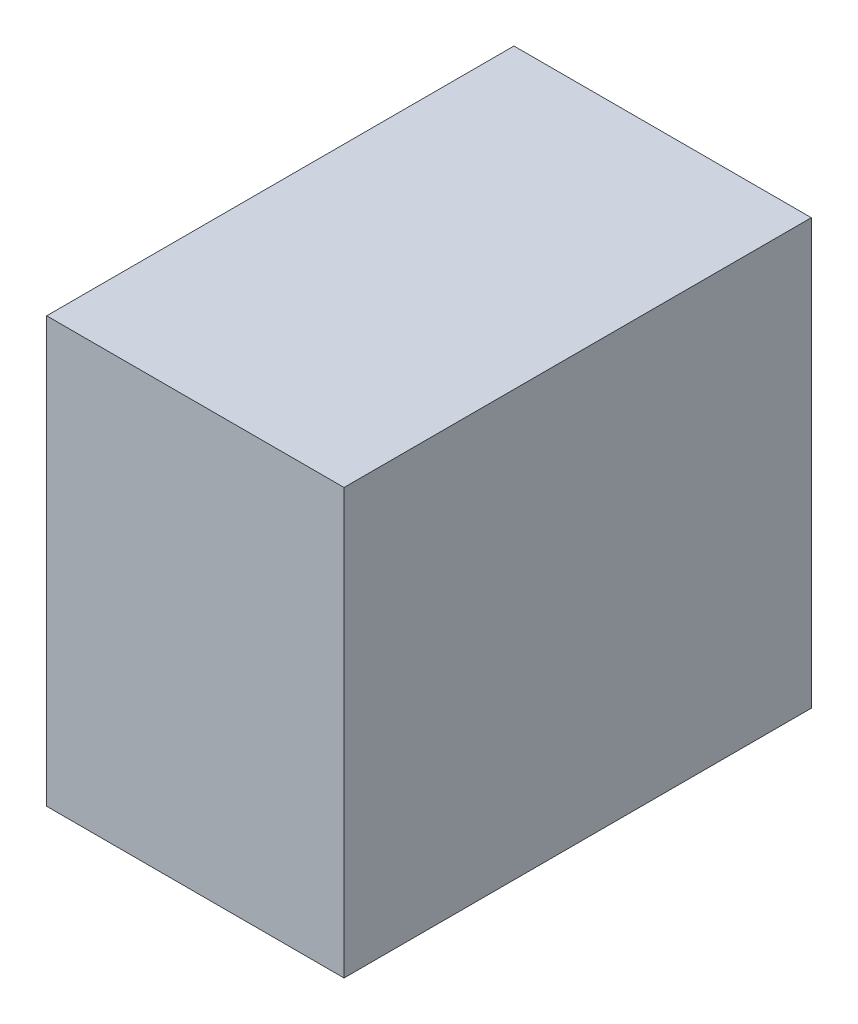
ISO-10303-21;
HEADER;
FILE_DESCRIPTION(('STEP AP214'),'2;1');
FILE_NAME('part.step','',(''),(''),'','','');
FILE_SCHEMA(('AUTOMOTIVE_DESIGN { 1 0 10303 214 1 1 1 1 }'));
ENDSEC;
DATA;
#1=APPLICATION_CONTEXT('core data for automotive mechanical design processes');
#2=APPLICATION_PROTOCOL_DEFINITION('international standard','automotive_design',2000,#1);
#3=PRODUCT_CONTEXT('',#1,'mechanical');
#4=PRODUCT('Part','Part','',(#3));
#5=PRODUCT_RELATED_PRODUCT_CATEGORY('part','',(#4));
#6=PRODUCT_DEFINITION_FORMATION('','',#4);
#7=PRODUCT_DEFINITION_CONTEXT('part definition',#1,'design');
#8=PRODUCT_DEFINITION('design','',#6,#7);
#9=PRODUCT_DEFINITION_SHAPE('','',#8);
#10=(LENGTH_UNIT() NAMED_UNIT(*) SI_UNIT(.MILLI.,.METRE.));
#11=(NAMED_UNIT(*) PLANE_ANGLE_UNIT() SI_UNIT($,.RADIAN.));
#12=(NAMED_UNIT(*) SI_UNIT($,.STERADIAN.) SOLID_ANGLE_UNIT());
#13=UNCERTAINTY_MEASURE_WITH_UNIT(LENGTH_MEASURE(1.E-05),#10,'distance_accuracy_value','');
#14=(GEOMETRIC_REPRESENTATION_CONTEXT(3) GLOBAL_UNCERTAINTY_ASSIGNED_CONTEXT((#13)) GLOBAL_UNIT_ASSIGNED_CONTEXT((#10,
#11,#12)) REPRESENTATION_CONTEXT('',''));
#15=CARTESIAN_POINT('',(0.,0.,0.));
#16=DIRECTION('',(0.,0.,1.));
#17=DIRECTION('',(1.,0.,0.));
#18=AXIS2_PLACEMENT_3D('',#15,#16,#17);
#19=CARTESIAN_POINT('',(1.270000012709E-06,0.,0.5499989));
#20=DIRECTION('',(0.,0.,-1.));
#21=DIRECTION('',(0.,-1.,0.));
#22=AXIS2_PLACEMENT_3D('',#19,#20,#21);
#23=PLANE('',#22);
#24=DIRECTION('',(0.,-1.,0.));
#25=VECTOR('',#24,1.);
#26=CARTESIAN_POINT('',(0.17500092,0.2499995,0.5499989));
#27=LINE('',#26,#25);
#28=CARTESIAN_POINT('',(0.17500092,0.2499995,0.5499989));
#29=VERTEX_POINT('',#28);
#30=CARTESIAN_POINT('',(0.17500092,-0.2499995,0.5499989));
#31=VERTEX_POINT('',#30);
#32=EDGE_CURVE('E20',#29,#31,#27,.T.);
#33=ORIENTED_EDGE('',*,*,#32,.F.);
#34=DIRECTION('',(1.,0.,0.));
#35=VECTOR('',#34,1.);
#36=CARTESIAN_POINT('',(-0.17499838,0.2499995,0.5499989));
#37=LINE('',#36,#35);
#38=CARTESIAN_POINT('',(-0.17499838,0.2499995,0.5499989));
#39=VERTEX_POINT('',#38);
#40=EDGE_CURVE('E108',#39,#29,#37,.T.);
#41=ORIENTED_EDGE('',*,*,#40,.F.);
#42=DIRECTION('',(0.,1.,0.));
#43=VECTOR('',#42,1.);
#44=CARTESIAN_POINT('',(-0.17499838,-0.2499995,0.5499989));
#45=LINE('',#44,#43);
#46=CARTESIAN_POINT('',(-0.17499838,-0.2499995,0.5499989));
#47=VERTEX_POINT('',#46);
#48=EDGE_CURVE('E84',#47,#39,#45,.T.);
#49=ORIENTED_EDGE('',*,*,#48,.F.);
#50=DIRECTION('',(-1.,0.,0.));
#51=VECTOR('',#50,1.);
#52=CARTESIAN_POINT('',(0.17500092,-0.2499995,0.5499989));
#53=LINE('',#52,#51);
#54=EDGE_CURVE('E88',#31,#47,#53,.T.);
#55=ORIENTED_EDGE('',*,*,#54,.F.);
#56=EDGE_LOOP('',(#33,#41,#49,#55));
#57=FACE_BOUND('',#56,.T.);
#58=ADVANCED_FACE('F17',(#57),#23,.F.);
#59=CARTESIAN_POINT('',(1.270000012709E-06,0.,0.));
#60=DIRECTION('',(0.,0.,-1.));
#61=DIRECTION('',(0.,-1.,0.));
#62=AXIS2_PLACEMENT_3D('',#59,#60,#61);
#63=PLANE('',#62);
#64=DIRECTION('',(-1.,0.,0.));
#65=VECTOR('',#64,1.);
#66=CARTESIAN_POINT('',(0.17500092,-0.2499995,0.));
#67=LINE('',#66,#65);
#68=CARTESIAN_POINT('',(0.17500092,-0.2499995,0.));
#69=VERTEX_POINT('',#68);
#70=CARTESIAN_POINT('',(-0.17499838,-0.2499995,0.));
#71=VERTEX_POINT('',#70);
#72=EDGE_CURVE('E72',#69,#71,#67,.T.);
#73=ORIENTED_EDGE('',*,*,#72,.T.);
#74=DIRECTION('',(0.,1.,0.));
#75=VECTOR('',#74,1.);
#76=CARTESIAN_POINT('',(-0.17499838,-0.2499995,0.));
#77=LINE('',#76,#75);
#78=CARTESIAN_POINT('',(-0.17499838,0.2499995,0.));
#79=VERTEX_POINT('',#78);
#80=EDGE_CURVE('E105',#71,#79,#77,.T.);
#81=ORIENTED_EDGE('',*,*,#80,.T.);
#82=DIRECTION('',(1.,0.,0.));
#83=VECTOR('',#82,1.);
#84=CARTESIAN_POINT('',(-0.17499838,0.2499995,0.));
#85=LINE('',#84,#83);
#86=CARTESIAN_POINT('',(0.17500092,0.2499995,0.));
#87=VERTEX_POINT('',#86);
#88=EDGE_CURVE('E74',#79,#87,#85,.T.);
#89=ORIENTED_EDGE('',*,*,#88,.T.);
#90=DIRECTION('',(0.,-1.,0.));
#91=VECTOR('',#90,1.);
#92=CARTESIAN_POINT('',(0.17500092,0.2499995,0.));
#93=LINE('',#92,#91);
#94=EDGE_CURVE('E11',#87,#69,#93,.T.);
#95=ORIENTED_EDGE('',*,*,#94,.T.);
#96=EDGE_LOOP('',(#73,#81,#89,#95));
#97=FACE_BOUND('',#96,.T.);
#98=ADVANCED_FACE('F70',(#97),#63,.T.);
#99=CARTESIAN_POINT('',(0.17500092,0.2499995,0.));
#100=DIRECTION('',(1.,0.,0.));
#101=DIRECTION('',(0.,1.,0.));
#102=AXIS2_PLACEMENT_3D('',#99,#100,#101);
#103=PLANE('',#102);
#104=DIRECTION('',(0.,0.,1.));
#105=VECTOR('',#104,1.);
#106=CARTESIAN_POINT('',(0.17500092,0.2499995,0.));
#107=LINE('',#106,#105);
#108=EDGE_CURVE('E112',#87,#29,#107,.T.);
#109=ORIENTED_EDGE('',*,*,#108,.T.);
#110=ORIENTED_EDGE('',*,*,#32,.T.);
#111=DIRECTION('',(0.,0.,1.));
#112=VECTOR('',#111,1.);
#113=CARTESIAN_POINT('',(0.17500092,-0.2499995,0.));
#114=LINE('',#113,#112);
#115=EDGE_CURVE('E80',#69,#31,#114,.T.);
#116=ORIENTED_EDGE('',*,*,#115,.F.);
#117=ORIENTED_EDGE('',*,*,#94,.F.);
#118=EDGE_LOOP('',(#109,#110,#116,#117));
#119=FACE_BOUND('',#118,.T.);
#120=ADVANCED_FACE('F86',(#119),#103,.T.);
#121=CARTESIAN_POINT('',(-0.17499838,0.2499995,0.));
#122=DIRECTION('',(0.,1.,0.));
#123=DIRECTION('',(1.,0.,0.));
#124=AXIS2_PLACEMENT_3D('',#121,#122,#123);
#125=PLANE('',#124);
#126=DIRECTION('',(0.,0.,1.));
#127=VECTOR('',#126,1.);
#128=CARTESIAN_POINT('',(-0.17499838,0.2499995,0.));
#129=LINE('',#128,#127);
#130=EDGE_CURVE('E99',#79,#39,#129,.T.);
#131=ORIENTED_EDGE('',*,*,#130,.T.);
#132=ORIENTED_EDGE('',*,*,#40,.T.);
#133=ORIENTED_EDGE('',*,*,#108,.F.);
#134=ORIENTED_EDGE('',*,*,#88,.F.);
#135=EDGE_LOOP('',(#131,#132,#133,#134));
#136=FACE_BOUND('',#135,.T.);
#137=ADVANCED_FACE('F141',(#136),#125,.T.);
#138=CARTESIAN_POINT('',(-0.17499838,-0.2499995,0.));
#139=DIRECTION('',(-1.,0.,0.));
#140=DIRECTION('',(0.,0.,1.));
#141=AXIS2_PLACEMENT_3D('',#138,#139,#140);
#142=PLANE('',#141);
#143=DIRECTION('',(0.,0.,1.));
#144=VECTOR('',#143,1.);
#145=CARTESIAN_POINT('',(-0.17499838,-0.2499995,0.));
#146=LINE('',#145,#144);
#147=EDGE_CURVE('E82',#71,#47,#146,.T.);
#148=ORIENTED_EDGE('',*,*,#147,.T.);
#149=ORIENTED_EDGE('',*,*,#48,.T.);
#150=ORIENTED_EDGE('',*,*,#130,.F.);
#151=ORIENTED_EDGE('',*,*,#80,.F.);
#152=EDGE_LOOP('',(#148,#149,#150,#151));
#153=FACE_BOUND('',#152,.T.);
#154=ADVANCED_FACE('F131',(#153),#142,.T.);
#155=CARTESIAN_POINT('',(0.17500092,-0.2499995,0.));
#156=DIRECTION('',(0.,-1.,0.));
#157=DIRECTION('',(0.,0.,-1.));
#158=AXIS2_PLACEMENT_3D('',#155,#156,#157);
#159=PLANE('',#158);
#160=ORIENTED_EDGE('',*,*,#115,.T.);
#161=ORIENTED_EDGE('',*,*,#54,.T.);
#162=ORIENTED_EDGE('',*,*,#147,.F.);
#163=ORIENTED_EDGE('',*,*,#72,.F.);
#164=EDGE_LOOP('',(#160,#161,#162,#163));
#165=FACE_BOUND('',#164,.T.);
#166=ADVANCED_FACE('F78',(#165),#159,.T.);
#167=CLOSED_SHELL('',(#58,#98,#120,#137,#154,#166));
#168=MANIFOLD_SOLID_BREP('B1',#167);
#169=ADVANCED_BREP_SHAPE_REPRESENTATION('',(#18,#168),#14);
#170=SHAPE_DEFINITION_REPRESENTATION(#9,#169);
ENDSEC;
END-ISO-10303-21;
